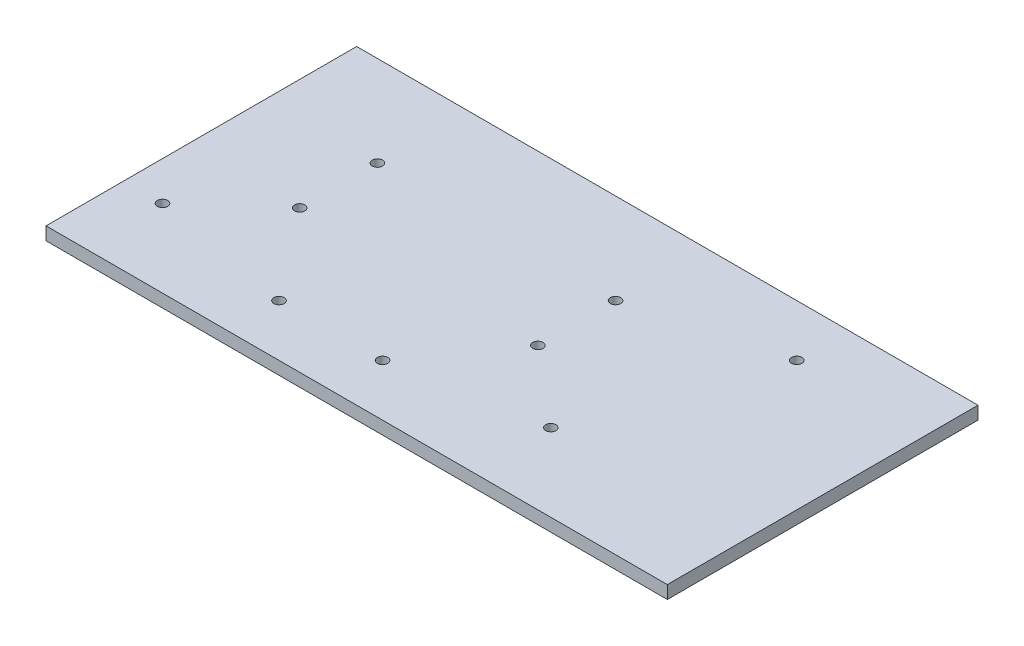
from build123d import *

# Parameters (mm, degrees)
SKETCH1_W      = 240
SKETCH1_H      = 120
SKETCH1_R      = 2
EXTRUDE1_DEPTH = 5


with BuildPart() as part:
    # Sketch1 → Extrude1 (new body)
    with BuildSketch(Plane(origin=(0, 0, 0), x_dir=(1, 0, 0), z_dir=(0, 1, 0))):
        with Locations((120, 60)):
            Rectangle(SKETCH1_W, SKETCH1_H)
        with Locations(Location((15, 30, 0), (0, 0, 270))):
            Circle(SKETCH1_R, mode=Mode.SUBTRACT)
        with Locations(Location((70, 20, 0), (0, 0, 270))):
            Circle(SKETCH1_R, mode=Mode.SUBTRACT)
        with Locations(Location((110, 20, 0), (0, 0, 270))):
            Circle(SKETCH1_R, mode=Mode.SUBTRACT)
        with Locations(Location((165, 30, 0), (0, 0, 270))):
            Circle(SKETCH1_R, mode=Mode.SUBTRACT)
        with Locations(Location((190, 100, 0), (0, 0, 270))):
            Circle(SKETCH1_R, mode=Mode.SUBTRACT)
        with Locations(Location((135, 85, 0), (0, 0, 270))):
            Circle(SKETCH1_R, mode=Mode.SUBTRACT)
        with Locations(Location((43, 85, 0), (0, 0, 270))):
            Circle(SKETCH1_R, mode=Mode.SUBTRACT)
        with Locations(Location((43, 55, 0), (0, 0, 270))):
            Circle(SKETCH1_R, mode=Mode.SUBTRACT)
        with Locations(Location((135, 55, 0), (0, 0, 270))):
            Circle(SKETCH1_R, mode=Mode.SUBTRACT)
    extrude(amount=EXTRUDE1_DEPTH)


solid = part.part
